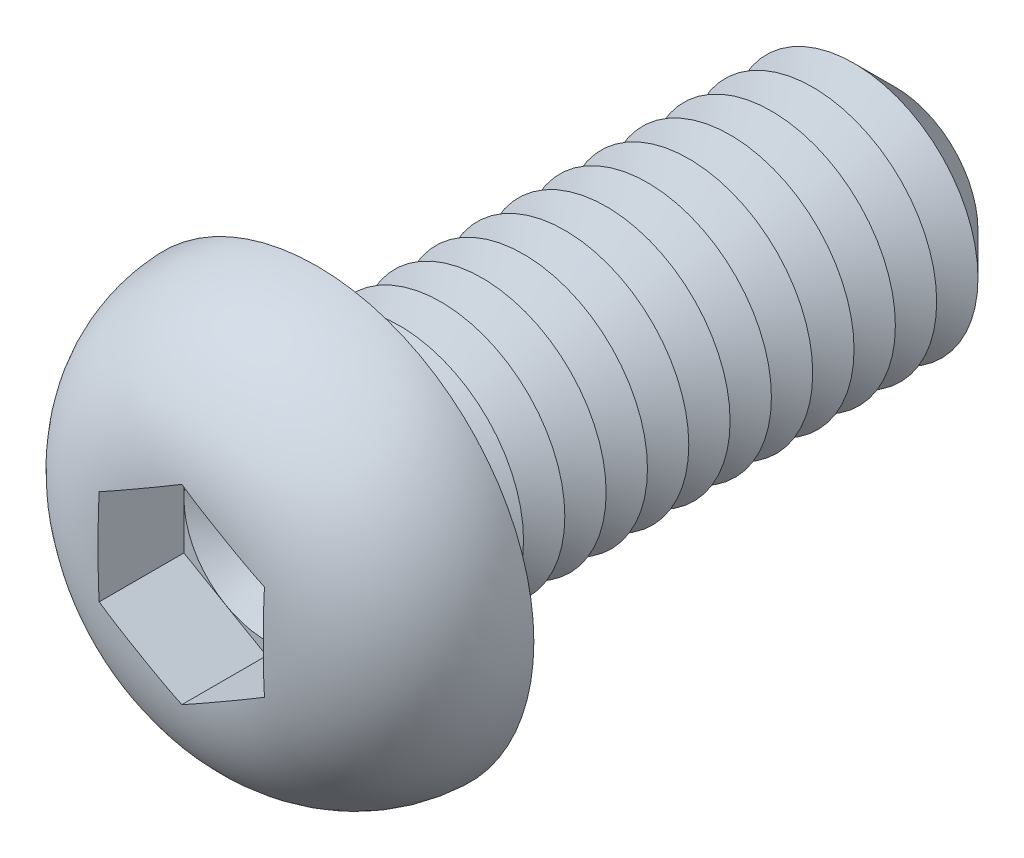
from build123d import *

# Parameters (mm, degrees)
CUT_EXTRUDE1_DEPTH  = 2.08
SKETCH4_R           = 3
BOSS_EXTRUDE1_DEPTH = 14
CHAMFER1_SIZE       = 1
LPATTERN1_COUNT     = 12
LPATTERN1_PITCH     = 1
FILLET2_R           = 0.5


with BuildPart() as part:
    # Sketch2 → Revolve1 (revolve)
    with BuildSketch(Plane(origin=(0, 0, 0), x_dir=(0, 0, -1), z_dir=(1, 0, 0)), mode=Mode.PRIVATE) as revolve1_sk:
        with BuildLine():
            Line((0, 0), (-3.3, 0))
            Line((-3.3, 0), (-3.3, 1.851470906))
            ThreePointArc((-3.3, 1.851470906), (-2.339262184, 4.220014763), (0, 5.25))
            Line((0, 5.25), (0, 0))
        make_face()
    revolve(revolve1_sk.sketch.rotate(Axis((0, 0, 47.934239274), (0, 0, -1)), 90), axis=Axis((0, 0, 47.934239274), (0, 0, -1)))

    # Sketch3 → Cut-Extrude1 (cut)
    with BuildSketch(Plane.XY.offset(3.3)):
        Polygon((0, 2.309401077), (-2, 1.154700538), (-2, -1.154700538), (0, -2.309401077), (2, -1.154700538), (2, 1.154700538), align=None)
    extrude(amount=-CUT_EXTRUDE1_DEPTH, mode=Mode.SUBTRACT)

    # Sketch4 → Boss-Extrude1 (add)
    with BuildSketch(Plane(origin=(0, 0, 0), x_dir=(-1, 0, 0), z_dir=(0, 0, -1))):
        Circle(SKETCH4_R)
    extrude(amount=BOSS_EXTRUDE1_DEPTH)

    # Chamfer1
    chamfer1_edges = [part.edges().sort_by_distance(p)[0] for p in [
        (3, 0, -14),
    ]]
    chamfer(chamfer1_edges, length=CHAMFER1_SIZE)

    # Sketch5 → Cut-Revolve1 (revolve, cut)
    with BuildSketch(Plane(origin=(0, 0, 0), x_dir=(0, 0, -1), z_dir=(1, 0, 0)), mode=Mode.PRIVATE) as cut_revolve1_sk:
        Polygon((1, 3), (2, 3), (1.5, 2.133974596), align=None)
    cut_revolve1 = revolve(cut_revolve1_sk.sketch.rotate(Axis((0, 0, 47.934239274), (0, 0, -1)), 90), axis=Axis((0, 0, 47.934239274), (0, 0, -1)), mode=Mode.SUBTRACT)

    # LPattern1: Cut-Revolve1 ×12
    with Locations(*[(0, 0, -i * LPATTERN1_PITCH) for i in range(1, LPATTERN1_COUNT)]):
        add(cut_revolve1, mode=Mode.SUBTRACT)

    # Fillet2
    fillet2_edges = [part.edges().sort_by_distance(p)[0] for p in [
        (3, 0, 0),
    ]]
    fillet(fillet2_edges, radius=FILLET2_R)

    # Cut-Extrude2 cone 1 section (on through the dimple's axis) → Cut-Extrude2 (revolve, cut)
    with BuildSketch(Plane(origin=(0, 0, 1.22), x_dir=(0, -1, 0), z_dir=(1, 0, 0))):
        Polygon((0, 0), (2, 0), (0, 1.154700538), align=None)
    revolve(axis=Axis((0, 0, 1.22), (0, 0, -1)), mode=Mode.SUBTRACT)


solid = part.part
